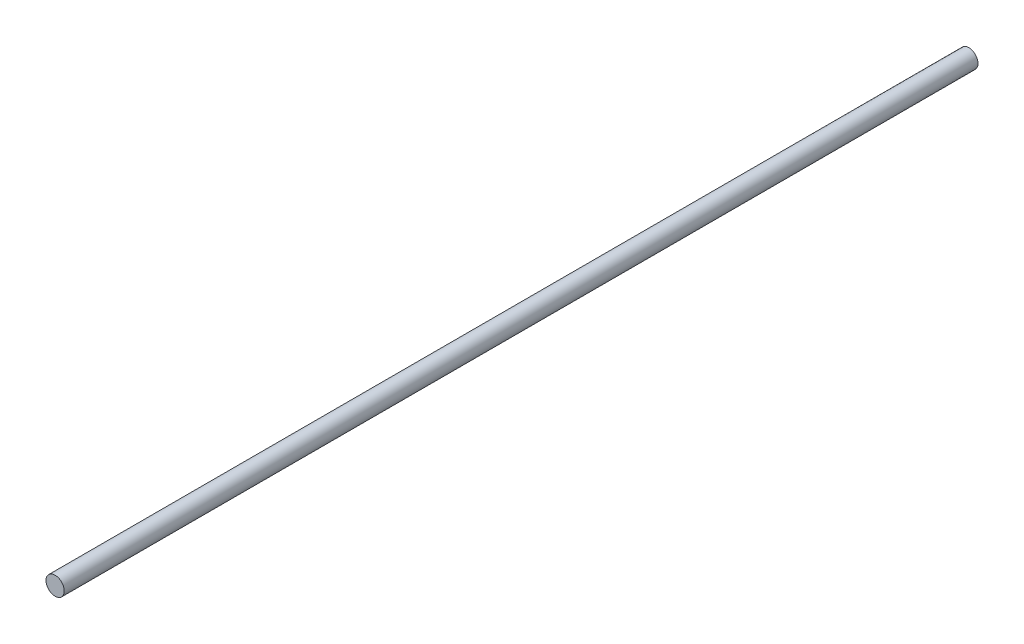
from build123d import *

# Parameters (mm, degrees)
CROQUIS1_R              = 4
SALIENTE_EXTRUIR1_DEPTH = 400


with BuildPart() as part:
    # Croquis1 → Saliente-Extruir1 (new body)
    with BuildSketch(Plane.XY):
        Circle(CROQUIS1_R)
    extrude(amount=SALIENTE_EXTRUIR1_DEPTH)


solid = part.part
